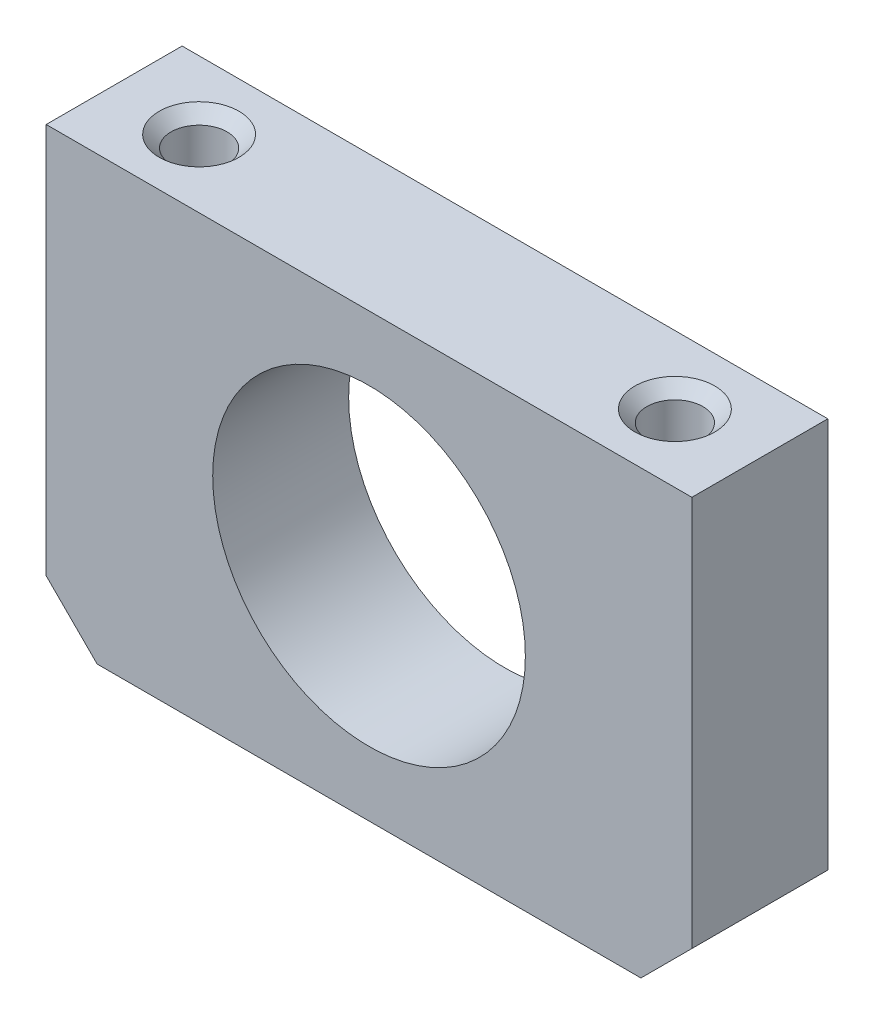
from build123d import *

# Parameters (mm, degrees)
SKETCH_1_W            = 38
SKETCH_1_H            = 26
EXTRUDE_1_DEPTH       = 8
SKETCH_2_R            = 9.2
CUT_EXTRUDE_1_DEPTH   = 47.733285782
CHAMFER_1_SIZE        = 3
HOLE_WIZARD_M41_D     = 3.3
HOLE_WIZARD_M41_DEPTH = 15
HOLE_WIZARD_M41_TIP   = 0.991420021
CHAMFER_2_SIZE        = 0.7


with BuildPart() as part:
    # Sketch 1 → Extrude 1 (new body)
    with BuildSketch(Plane.XY):
        with Locations((19, 13)):
            Rectangle(SKETCH_1_W, SKETCH_1_H)
    extrude(amount=EXTRUDE_1_DEPTH)

    # Sketch 2 → Cut-Extrude 1 (cut, through all)
    with BuildSketch(Plane(origin=(0, 0, 0), x_dir=(-1, 0, 0), z_dir=(0, 0, -1))):
        with Locations((-19, 13)):
            Circle(SKETCH_2_R)
    extrude(amount=-CUT_EXTRUDE_1_DEPTH, mode=Mode.SUBTRACT)

    # Chamfer 1
    chamfer_1_edges = [part.edges().sort_by_distance(p)[0] for p in [
        (38, 0, 4),
        (0, 0, 4),
    ]]
    chamfer(chamfer_1_edges, length=CHAMFER_1_SIZE)

    # Hole Wizard M41
    with Locations(Plane(origin=(0, 26, 0), x_dir=(1, 0, 0), z_dir=(0, 1, 0))):
        with Locations((33, -4), (5, -4)):
            Hole(HOLE_WIZARD_M41_D / 2, depth=HOLE_WIZARD_M41_DEPTH)
            with Locations((0, 0, -(HOLE_WIZARD_M41_DEPTH + HOLE_WIZARD_M41_TIP / 2))):  # 118° drill point
                Cone(0, HOLE_WIZARD_M41_D / 2, HOLE_WIZARD_M41_TIP, mode=Mode.SUBTRACT)

    # Chamfer 2
    chamfer_2_edges = [part.edges().sort_by_distance(p)[0] for p in [
        (6.65, 26, 4),
        (34.65, 26, 4),
    ]]
    chamfer(chamfer_2_edges, length=CHAMFER_2_SIZE)


solid = part.part
